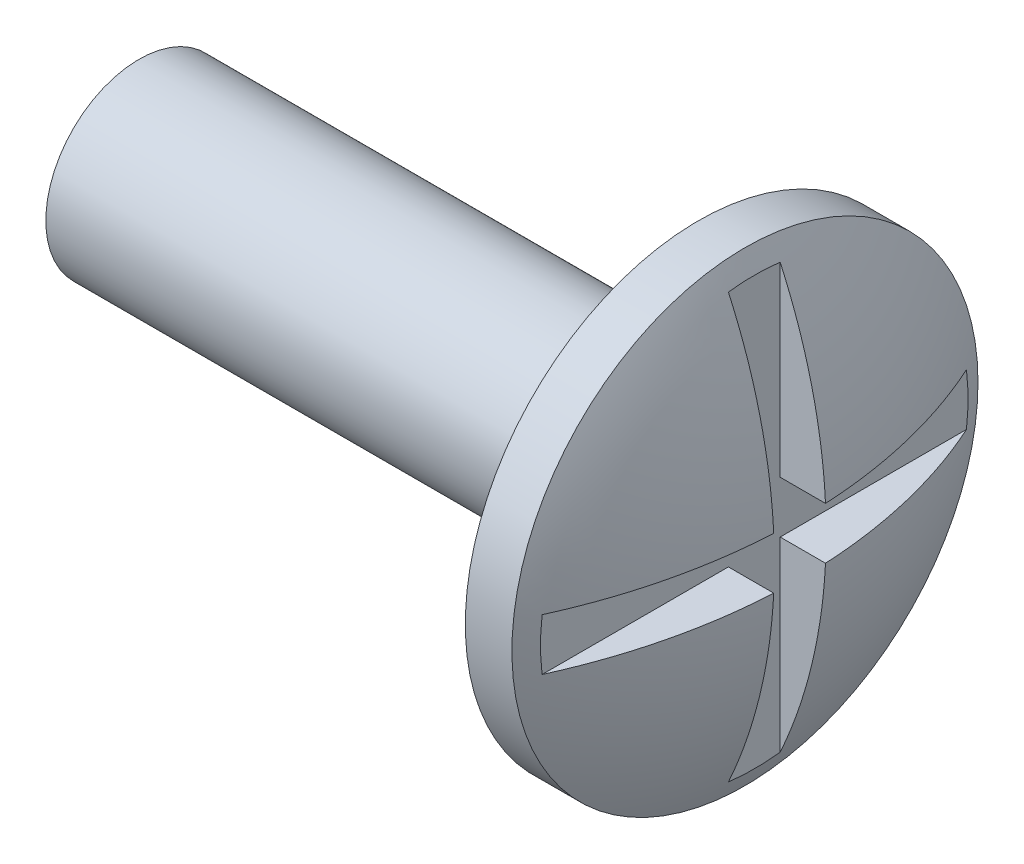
from build123d import *

# Parameters (mm, degrees)
ENL_V_MAT_EXTRU_1_DEPTH = 15.974645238


with BuildPart() as part:
    # Esquisse1 → R_volution1 (revolve)
    with BuildSketch(Plane.XY, mode=Mode.PRIVATE) as r_volution1_sk:
        with BuildLine():
            Line((0, 0), (-14.2, 0))
            Line((-14.2, 0), (-14.2, 2))
            Line((-14.2, 2), (-2.2, 2))
            Line((-2.2, 2), (-2.2, 5))
            Line((-2.2, 5), (-1.2, 5))
            ThreePointArc((-1.2, 5), (-0.30419989, 2.570992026), (0, 0))
        make_face()
    revolve(r_volution1_sk.sketch.rotate(Axis((0, 0, 0), (-1, 0, 0)), 90), axis=Axis((0, 0, 0), (-1, 0, 0)))

    # Esquisse2 → Enl_v. mat.-Extru.1 (cut, through all)
    with BuildSketch(Plane.ZY.offset(1)):
        Polygon((0.555555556, 0.555555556), (0.555555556, 5), (-0.555555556, 5), (-0.555555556, 0.555555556), (-5, 0.555555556), (-5, -0.555555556), (-0.555555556, -0.555555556), (-0.555555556, -5), (0.555555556, -5), (0.555555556, -0.555555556), (5, -0.555555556), (5, 0.555555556), align=None)
    extrude(amount=-ENL_V_MAT_EXTRU_1_DEPTH, mode=Mode.SUBTRACT)


solid = part.part
